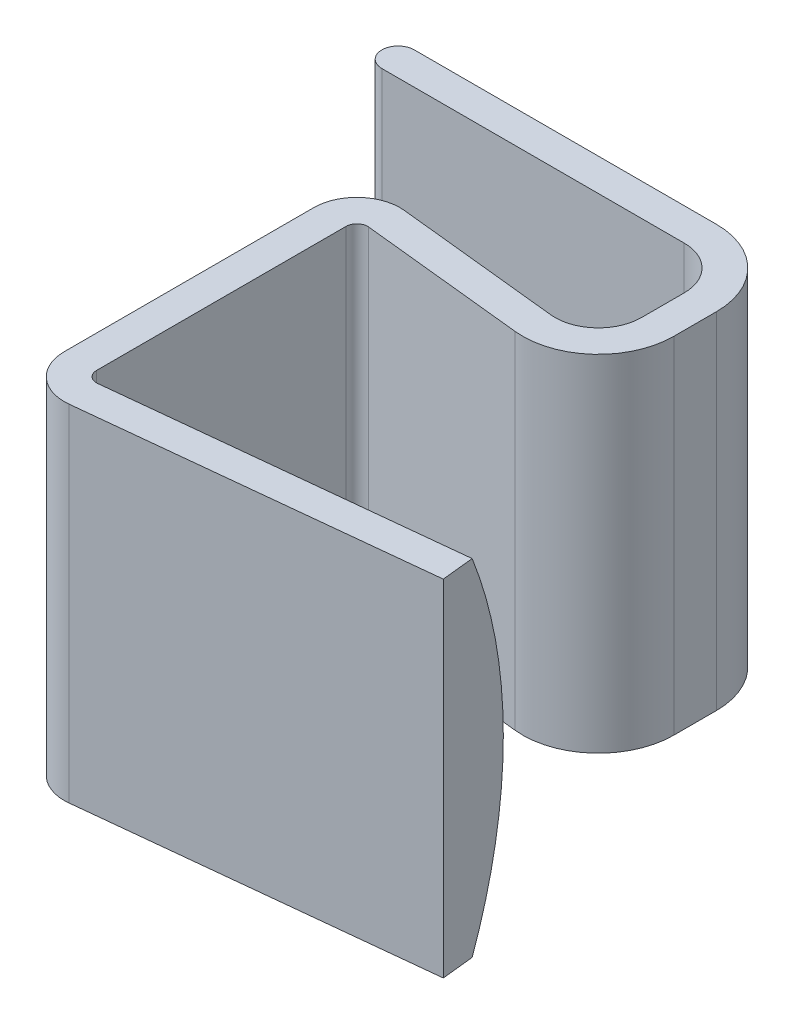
from build123d import *

# Parameters (mm, degrees)
BOSS_EXTRUDE1_DEPTH = 50.8
BOSS_EXTRUDE2_REACH = 101.253


with BuildPart() as part:
    # Sketch1 → Boss-Extrude1 (new body)
    with BuildSketch(Plane(origin=(0, 0, 0), x_dir=(1, 0, 0), z_dir=(0, 1, 0))):
        with BuildLine():
            Line((0.084571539, 50.838100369), (44.534571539, 50.838100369))
            ThreePointArc((44.534571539, 50.838100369), (49.0246996, 48.97822843), (50.884571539, 44.488100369))
            Line((50.884571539, 44.488100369), (50.884571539, 38.205489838))
            ThreePointArc((50.884571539, 38.205489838), (48.78355089, 33.486520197), (43.870815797, 31.890275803))
            Line((43.870815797, 31.890275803), (19.798327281, 34.420396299))
            ThreePointArc((19.798327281, 34.420396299), (14.885592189, 32.824151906), (12.784571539, 28.105182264))
            Line((12.784571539, 28.105182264), (12.784571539, -8.590038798))
            ThreePointArc((12.784571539, -8.590038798), (14.885592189, -13.30900844), (19.798327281, -14.905252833))
            Line((19.798327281, -14.905252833), (69.62149786, -9.668626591))
            Line((69.62149786, -9.668626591), (69.123681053, -4.932216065))
            Line((69.123681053, -4.932216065), (19.300510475, -10.168842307))
            ThreePointArc((19.300510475, -10.168842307), (18.072326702, -9.769781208), (17.547071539, -8.590038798))
            Line((17.547071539, -8.590038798), (17.547071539, 28.105182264))
            ThreePointArc((17.547071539, 28.105182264), (18.072326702, 29.284924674), (19.300510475, 29.683985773))
            Line((19.300510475, 29.683985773), (43.372998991, 27.153865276))
            ThreePointArc((43.372998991, 27.153865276), (51.970285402, 29.947292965), (55.647071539, 38.205489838))
            Line((55.647071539, 38.205489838), (55.647071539, 44.488100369))
            ThreePointArc((55.647071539, 44.488100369), (52.392295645, 52.345824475), (44.534571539, 55.600600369))
            Line((44.534571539, 55.600600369), (0.084571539, 55.600600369))
            ThreePointArc((0.084571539, 55.600600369), (-2.296678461, 53.219350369), (0.084571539, 50.838100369))
        make_face()
    extrude(amount=BOSS_EXTRUDE1_DEPTH)

    # Sketch2 → Boss-Extrude2 (add, up to next)
    with BuildSketch(Plane(origin=(67.855689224, 0, -7.131920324), x_dir=(-0.10452846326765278, 0, -0.9945218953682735), z_dir=(0.9945218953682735, 0, -0.10452846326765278)), mode=Mode.PRIVATE) as boss_extrude2_sk1:
        with BuildLine():
            Line((-12.130589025, 50.8), (-12.130589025, 0))
            ThreePointArc((-12.130589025, 0), (-6.977952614, 25.4), (-12.130589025, 50.8))
        make_face()
    boss_extrude2_tool1 = extrude(boss_extrude2_sk1.sketch, amount=-BOSS_EXTRUDE2_REACH, mode=Mode.PRIVATE) - part.part
    add(boss_extrude2_tool1.solids().sort_by_distance((68.907495, 25.4, 2.875345))[0])


solid = part.part
